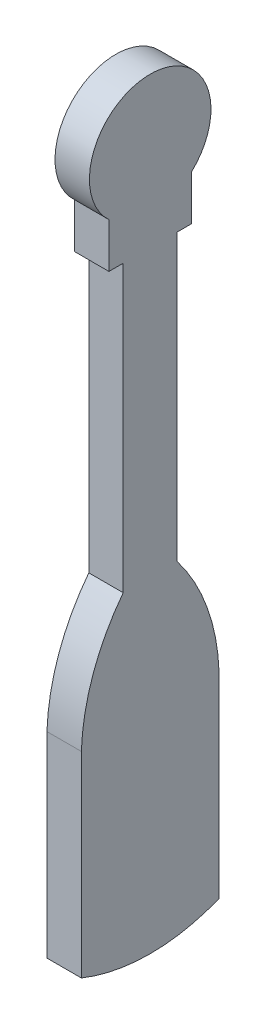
from build123d import *

# Parameters (mm, degrees)
SALIENTE_EXTRUIR1_DEPTH = 15


with BuildPart() as part:
    # Croquis1 → Saliente-Extruir1 (new body)
    with BuildSketch(Plane(origin=(0, 0, 0), x_dir=(0, 0, -1), z_dir=(1, 0, 0))):
        with BuildLine():
            Line((12788.263634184, 4836.46374072), (12788.263634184, 4816.89710711))
            Line((12788.263634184, 4816.89710711), (12794.481725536, 4816.89710711))
            Line((12794.481725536, 4816.89710711), (12794.481725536, 4692.532977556))
            ThreePointArc((12794.481725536, 4692.532977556), (12781.398230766, 4668.569076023), (12776.2490065, 4641.756170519))
            Line((12776.2490065, 4641.756170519), (12776.2490065, 4556.250917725))
            ThreePointArc((12776.2490065, 4556.250917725), (12806.2490065, 4550.40129221), (12836.2490065, 4556.250917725))
            Line((12836.2490065, 4556.250917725), (12836.2490065, 4641.756170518))
            ThreePointArc((12836.2490065, 4641.756170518), (12831.099782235, 4668.569076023), (12818.016287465, 4692.532977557))
            Line((12818.016287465, 4692.532977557), (12818.016287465, 4816.89710711))
            Line((12818.016287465, 4816.89710711), (12824.234378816, 4816.89710711))
            Line((12824.234378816, 4816.89710711), (12824.234378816, 4836.46374072))
            ThreePointArc((12824.234378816, 4836.46374072), (12806.2490065, 4882.378306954), (12788.263634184, 4836.46374072))
        make_face()
    extrude(amount=SALIENTE_EXTRUIR1_DEPTH)


solid = part.part
